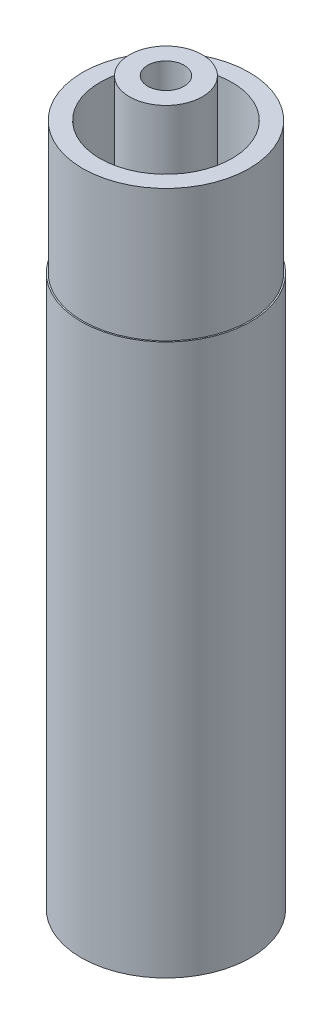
from build123d import *


with BuildPart() as part:
    # Sketch1 → Revolve1 (revolve)
    with BuildSketch(Plane.XY, mode=Mode.PRIVATE) as revolve1_sk:
        Polygon((-2.2733, 0), (-4.7244, 0), (-4.7244, 30.734), (-4.6482, 30.734), (-4.6482, 38.1), (-3.683, 38.1), (-3.683, 30.734), (-2.032, 30.734), (-2.032, 40.259), (-1.016, 40.259), (-1.016, 28.829), (-2.2733, 28.103097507), align=None)
    revolve(revolve1_sk.sketch.rotate(Axis((0, 0, 0), (0, -1, 0)), 270), axis=Axis((0, 0, 0), (0, -1, 0)))

    # Sketch2 → Revolve2 (revolve)
    with BuildSketch(Plane.XY, mode=Mode.PRIVATE) as revolve2_sk:
        Polygon((0, 11.662287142), (-4.1275, 10.16), (-4.1275, 6.35), (0, 6.35), align=None)
    revolve(revolve2_sk.sketch.rotate(Axis((0, 0, 0), (0, 1, 0)), 90), axis=Axis((0, 0, 0), (0, 1, 0)))


solid = part.part
